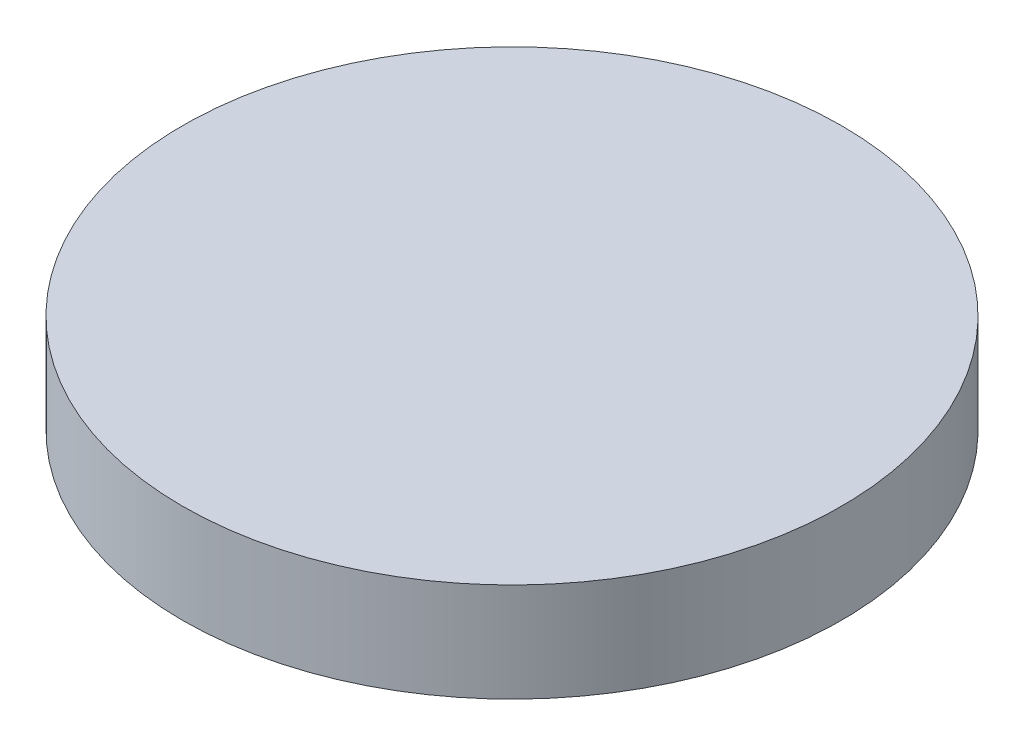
ISO-10303-21;
HEADER;
FILE_DESCRIPTION(('STEP AP214'),'2;1');
FILE_NAME('part.step','',(''),(''),'','','');
FILE_SCHEMA(('AUTOMOTIVE_DESIGN { 1 0 10303 214 1 1 1 1 }'));
ENDSEC;
DATA;
#1=APPLICATION_CONTEXT('core data for automotive mechanical design processes');
#2=APPLICATION_PROTOCOL_DEFINITION('international standard','automotive_design',2000,#1);
#3=PRODUCT_CONTEXT('',#1,'mechanical');
#4=PRODUCT('Part','Part','',(#3));
#5=PRODUCT_RELATED_PRODUCT_CATEGORY('part','',(#4));
#6=PRODUCT_DEFINITION_FORMATION('','',#4);
#7=PRODUCT_DEFINITION_CONTEXT('part definition',#1,'design');
#8=PRODUCT_DEFINITION('design','',#6,#7);
#9=PRODUCT_DEFINITION_SHAPE('','',#8);
#10=(LENGTH_UNIT() NAMED_UNIT(*) SI_UNIT(.MILLI.,.METRE.));
#11=(NAMED_UNIT(*) PLANE_ANGLE_UNIT() SI_UNIT($,.RADIAN.));
#12=(NAMED_UNIT(*) SI_UNIT($,.STERADIAN.) SOLID_ANGLE_UNIT());
#13=UNCERTAINTY_MEASURE_WITH_UNIT(LENGTH_MEASURE(1.E-05),#10,'distance_accuracy_value','');
#14=(GEOMETRIC_REPRESENTATION_CONTEXT(3) GLOBAL_UNCERTAINTY_ASSIGNED_CONTEXT((#13)) GLOBAL_UNIT_ASSIGNED_CONTEXT((#10,
#11,#12)) REPRESENTATION_CONTEXT('',''));
#15=CARTESIAN_POINT('',(0.,0.,0.));
#16=DIRECTION('',(0.,0.,1.));
#17=DIRECTION('',(1.,0.,0.));
#18=AXIS2_PLACEMENT_3D('',#15,#16,#17);
#19=CARTESIAN_POINT('',(0.,3.81,0.));
#20=DIRECTION('',(0.,-1.,0.));
#21=DIRECTION('',(0.,0.,-1.));
#22=AXIS2_PLACEMENT_3D('',#19,#20,#21);
#23=CYLINDRICAL_SURFACE('',#22,12.7);
#24=CARTESIAN_POINT('',(0.,3.81,0.));
#25=DIRECTION('',(0.,1.,0.));
#26=DIRECTION('',(0.,0.,1.));
#27=AXIS2_PLACEMENT_3D('',#24,#25,#26);
#28=CIRCLE('',#27,12.7);
#29=CARTESIAN_POINT('',(0.,3.81,-12.7));
#30=VERTEX_POINT('',#29);
#31=EDGE_CURVE('E10',#30,#30,#28,.T.);
#32=CARTESIAN_POINT('',(0.,0.,0.));
#33=DIRECTION('',(0.,1.,0.));
#34=DIRECTION('',(0.,0.,1.));
#35=AXIS2_PLACEMENT_3D('',#32,#33,#34);
#36=CIRCLE('',#35,12.7);
#37=CARTESIAN_POINT('',(0.,0.,-12.7));
#38=VERTEX_POINT('',#37);
#39=EDGE_CURVE('E34',#38,#38,#36,.T.);
#40=CARTESIAN_POINT('',(0.,3.81,-12.7));
#41=CARTESIAN_POINT('',(0.,3.7703125,-12.7));
#42=CARTESIAN_POINT('',(0.,3.730625,-12.7));
#43=CARTESIAN_POINT('',(0.,3.65125,-12.7));
#44=CARTESIAN_POINT('',(0.,3.6115625,-12.7));
#45=CARTESIAN_POINT('',(0.,3.5321875,-12.7));
#46=CARTESIAN_POINT('',(0.,3.4925,-12.7));
#47=CARTESIAN_POINT('',(0.,3.413125,-12.7));
#48=CARTESIAN_POINT('',(0.,3.3734375,-12.7));
#49=CARTESIAN_POINT('',(0.,3.2940625,-12.7));
#50=CARTESIAN_POINT('',(0.,3.254375,-12.7));
#51=CARTESIAN_POINT('',(0.,3.175,-12.7));
#52=CARTESIAN_POINT('',(0.,3.1353125,-12.7));
#53=CARTESIAN_POINT('',(0.,3.0559375,-12.7));
#54=CARTESIAN_POINT('',(0.,3.01625,-12.7));
#55=CARTESIAN_POINT('',(0.,2.936875,-12.7));
#56=CARTESIAN_POINT('',(0.,2.8971875,-12.7));
#57=CARTESIAN_POINT('',(0.,2.8178125,-12.7));
#58=CARTESIAN_POINT('',(0.,2.778125,-12.7));
#59=CARTESIAN_POINT('',(0.,2.69875,-12.7));
#60=CARTESIAN_POINT('',(0.,2.6590625,-12.7));
#61=CARTESIAN_POINT('',(0.,2.5796875,-12.7));
#62=CARTESIAN_POINT('',(0.,2.54,-12.7));
#63=CARTESIAN_POINT('',(0.,2.460625,-12.7));
#64=CARTESIAN_POINT('',(0.,2.4209375,-12.7));
#65=CARTESIAN_POINT('',(0.,2.3415625,-12.7));
#66=CARTESIAN_POINT('',(0.,2.301875,-12.7));
#67=CARTESIAN_POINT('',(0.,2.2225,-12.7));
#68=CARTESIAN_POINT('',(0.,2.1828125,-12.7));
#69=CARTESIAN_POINT('',(0.,2.1034375,-12.7));
#70=CARTESIAN_POINT('',(0.,2.06375,-12.7));
#71=CARTESIAN_POINT('',(0.,1.984375,-12.7));
#72=CARTESIAN_POINT('',(0.,1.9446875,-12.7));
#73=CARTESIAN_POINT('',(0.,1.8653125,-12.7));
#74=CARTESIAN_POINT('',(0.,1.825625,-12.7));
#75=CARTESIAN_POINT('',(0.,1.74625,-12.7));
#76=CARTESIAN_POINT('',(0.,1.7065625,-12.7));
#77=CARTESIAN_POINT('',(0.,1.6271875,-12.7));
#78=CARTESIAN_POINT('',(0.,1.5875,-12.7));
#79=CARTESIAN_POINT('',(0.,1.508125,-12.7));
#80=CARTESIAN_POINT('',(0.,1.4684375,-12.7));
#81=CARTESIAN_POINT('',(0.,1.3890625,-12.7));
#82=CARTESIAN_POINT('',(0.,1.349375,-12.7));
#83=CARTESIAN_POINT('',(0.,1.27,-12.7));
#84=CARTESIAN_POINT('',(0.,1.2303125,-12.7));
#85=CARTESIAN_POINT('',(0.,1.1509375,-12.7));
#86=CARTESIAN_POINT('',(0.,1.11125,-12.7));
#87=CARTESIAN_POINT('',(0.,1.031875,-12.7));
#88=CARTESIAN_POINT('',(0.,0.9921875,-12.7));
#89=CARTESIAN_POINT('',(0.,0.9128125,-12.7));
#90=CARTESIAN_POINT('',(0.,0.873125,-12.7));
#91=CARTESIAN_POINT('',(0.,0.79375,-12.7));
#92=CARTESIAN_POINT('',(0.,0.7540625,-12.7));
#93=CARTESIAN_POINT('',(0.,0.6746875,-12.7));
#94=CARTESIAN_POINT('',(0.,0.635,-12.7));
#95=CARTESIAN_POINT('',(0.,0.555625,-12.7));
#96=CARTESIAN_POINT('',(0.,0.5159375,-12.7));
#97=CARTESIAN_POINT('',(0.,0.4365625,-12.7));
#98=CARTESIAN_POINT('',(0.,0.396875,-12.7));
#99=CARTESIAN_POINT('',(0.,0.3175,-12.7));
#100=CARTESIAN_POINT('',(0.,0.2778125,-12.7));
#101=CARTESIAN_POINT('',(0.,0.1984375,-12.7));
#102=CARTESIAN_POINT('',(0.,0.15875,-12.7));
#103=CARTESIAN_POINT('',(0.,0.0793749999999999,-12.7));
#104=CARTESIAN_POINT('',(0.,0.0396874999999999,-12.7));
#105=CARTESIAN_POINT('',(0.,0.,-12.7));
#106=B_SPLINE_CURVE_WITH_KNOTS('',3,(#40,#41,#42,#43,#44,#45,#46,#47,#48,#49,#50,#51,#52,#53,
#54,#55,#56,#57,#58,#59,#60,#61,#62,#63,#64,#65,#66,#67,#68,#69,#70,#71,#72,#73,#74,#75,#76,#77,
#78,#79,#80,#81,#82,#83,#84,#85,#86,#87,#88,#89,#90,#91,#92,#93,#94,#95,#96,#97,#98,#99,#100,
#101,#102,#103,#104,#105),.UNSPECIFIED.,.F.,.F.,(4,2,2,2,2,2,2,2,2,2,2,2,2,2,2,2,2,2,2,2,2,2,2,
2,2,2,2,2,2,2,2,2,4),(0.,0.1190625,0.238125,0.3571875,0.47625,0.595312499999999,0.714375,
0.833437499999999,0.952499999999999,1.0715625,1.190625,1.3096875,1.42875,1.5478125,1.666875,
1.7859375,1.905,2.0240625,2.143125,2.2621875,2.38125,2.5003125,2.619375,2.7384375,2.8575,
2.9765625,3.095625,3.2146875,3.33375,3.4528125,3.571875,3.6909375,3.81),.UNSPECIFIED.);
#107=EDGE_CURVE('BSEAM31',#30,#38,#106,.T.);
#108=ORIENTED_EDGE('',*,*,#31,.F.);
#109=ORIENTED_EDGE('',*,*,#39,.T.);
#110=ORIENTED_EDGE('',*,*,#107,.T.);
#111=ORIENTED_EDGE('',*,*,#107,.F.);
#112=EDGE_LOOP('',(#108,#110,#109,#111));
#113=FACE_BOUND('',#112,.T.);
#114=ADVANCED_FACE('F31',(#113),#23,.T.);
#115=CARTESIAN_POINT('',(0.,3.81,0.));
#116=DIRECTION('',(0.,1.,0.));
#117=DIRECTION('',(0.,0.,1.));
#118=AXIS2_PLACEMENT_3D('',#115,#116,#117);
#119=PLANE('',#118);
#120=ORIENTED_EDGE('',*,*,#31,.T.);
#121=EDGE_LOOP('',(#120));
#122=FACE_BOUND('',#121,.T.);
#123=ADVANCED_FACE('F46',(#122),#119,.T.);
#124=CARTESIAN_POINT('',(0.,0.,0.));
#125=DIRECTION('',(0.,1.,0.));
#126=DIRECTION('',(0.,0.,1.));
#127=AXIS2_PLACEMENT_3D('',#124,#125,#126);
#128=PLANE('',#127);
#129=ORIENTED_EDGE('',*,*,#39,.F.);
#130=EDGE_LOOP('',(#129));
#131=FACE_BOUND('',#130,.T.);
#132=ADVANCED_FACE('F44',(#131),#128,.F.);
#133=CLOSED_SHELL('',(#114,#123,#132));
#134=MANIFOLD_SOLID_BREP('B2',#133);
#135=ADVANCED_BREP_SHAPE_REPRESENTATION('',(#18,#134),#14);
#136=SHAPE_DEFINITION_REPRESENTATION(#9,#135);
ENDSEC;
END-ISO-10303-21;
